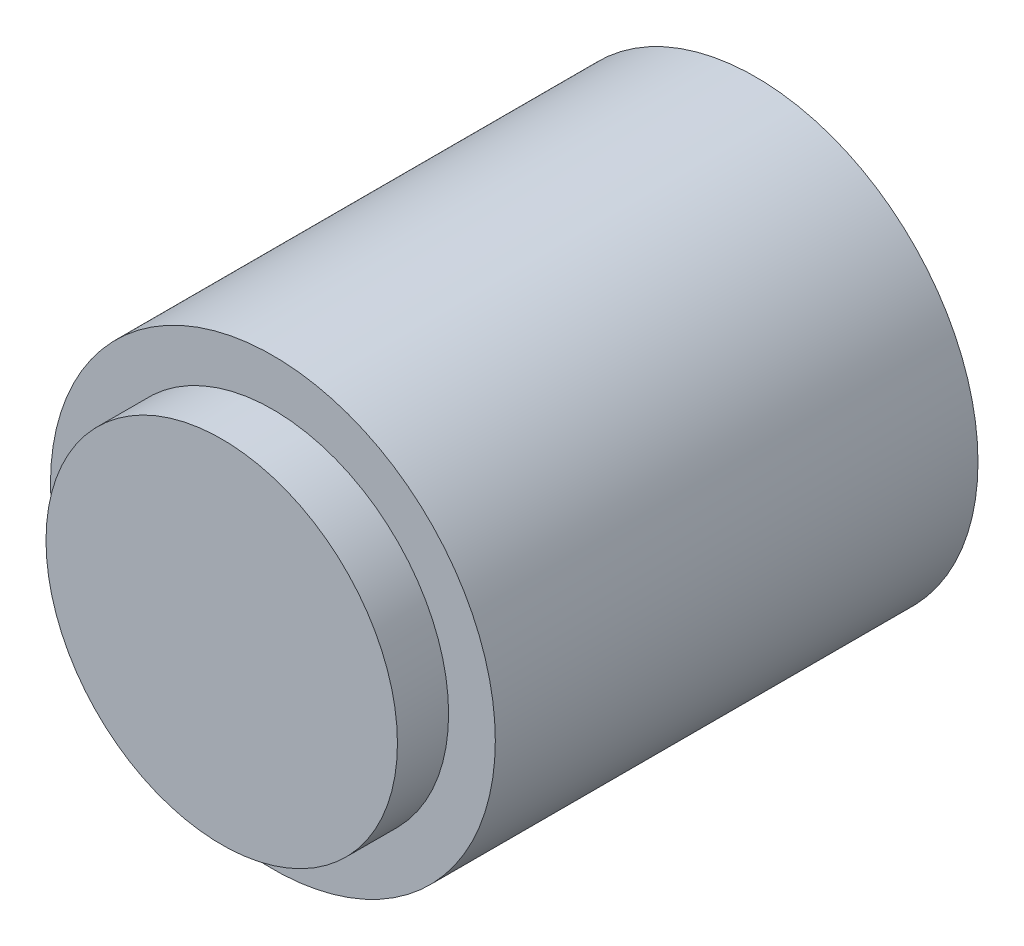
ISO-10303-21;
HEADER;
FILE_DESCRIPTION(('STEP AP214'),'2;1');
FILE_NAME('part.step','',(''),(''),'','','');
FILE_SCHEMA(('AUTOMOTIVE_DESIGN { 1 0 10303 214 1 1 1 1 }'));
ENDSEC;
DATA;
#1=APPLICATION_CONTEXT('core data for automotive mechanical design processes');
#2=APPLICATION_PROTOCOL_DEFINITION('international standard','automotive_design',2000,#1);
#3=PRODUCT_CONTEXT('',#1,'mechanical');
#4=PRODUCT('Part','Part','',(#3));
#5=PRODUCT_RELATED_PRODUCT_CATEGORY('part','',(#4));
#6=PRODUCT_DEFINITION_FORMATION('','',#4);
#7=PRODUCT_DEFINITION_CONTEXT('part definition',#1,'design');
#8=PRODUCT_DEFINITION('design','',#6,#7);
#9=PRODUCT_DEFINITION_SHAPE('','',#8);
#10=(LENGTH_UNIT() NAMED_UNIT(*) SI_UNIT(.MILLI.,.METRE.));
#11=(NAMED_UNIT(*) PLANE_ANGLE_UNIT() SI_UNIT($,.RADIAN.));
#12=(NAMED_UNIT(*) SI_UNIT($,.STERADIAN.) SOLID_ANGLE_UNIT());
#13=UNCERTAINTY_MEASURE_WITH_UNIT(LENGTH_MEASURE(1.E-05),#10,'distance_accuracy_value','');
#14=(GEOMETRIC_REPRESENTATION_CONTEXT(3) GLOBAL_UNCERTAINTY_ASSIGNED_CONTEXT((#13)) GLOBAL_UNIT_ASSIGNED_CONTEXT((#10,
#11,#12)) REPRESENTATION_CONTEXT('',''));
#15=CARTESIAN_POINT('',(0.,0.,0.));
#16=DIRECTION('',(0.,0.,1.));
#17=DIRECTION('',(1.,0.,0.));
#18=AXIS2_PLACEMENT_3D('',#15,#16,#17);
#19=CARTESIAN_POINT('',(0.,0.,32.));
#20=DIRECTION('',(0.,0.,1.));
#21=DIRECTION('',(1.,0.,0.));
#22=AXIS2_PLACEMENT_3D('',#19,#20,#21);
#23=CYLINDRICAL_SURFACE('',#22,5.);
#24=CARTESIAN_POINT('',(0.,0.,0.));
#25=DIRECTION('',(0.,0.,1.));
#26=DIRECTION('',(1.,0.,0.));
#27=AXIS2_PLACEMENT_3D('',#24,#25,#26);
#28=CIRCLE('',#27,5.);
#29=CARTESIAN_POINT('',(5.,0.,0.));
#30=VERTEX_POINT('',#29);
#31=EDGE_CURVE('E19',#30,#30,#28,.T.);
#32=ORIENTED_EDGE('',*,*,#31,.T.);
#33=EDGE_LOOP('',(#32));
#34=FACE_BOUND('',#33,.T.);
#35=CARTESIAN_POINT('',(0.,0.,10.85));
#36=DIRECTION('',(0.,0.,1.));
#37=DIRECTION('',(1.,0.,0.));
#38=AXIS2_PLACEMENT_3D('',#35,#36,#37);
#39=CIRCLE('',#38,5.);
#40=CARTESIAN_POINT('',(5.,0.,10.85));
#41=VERTEX_POINT('',#40);
#42=EDGE_CURVE('E28',#41,#41,#39,.T.);
#43=ORIENTED_EDGE('',*,*,#42,.F.);
#44=EDGE_LOOP('',(#43));
#45=FACE_BOUND('',#44,.T.);
#46=ADVANCED_FACE('F12',(#34,#45),#23,.T.);
#47=CARTESIAN_POINT('',(0.,0.,32.));
#48=DIRECTION('',(0.,0.,1.));
#49=DIRECTION('',(1.,0.,0.));
#50=AXIS2_PLACEMENT_3D('',#47,#48,#49);
#51=CYLINDRICAL_SURFACE('',#50,2.5);
#52=CARTESIAN_POINT('',(0.,0.,8.));
#53=DIRECTION('',(0.,0.,-1.));
#54=DIRECTION('',(-1.,0.,0.));
#55=AXIS2_PLACEMENT_3D('',#52,#53,#54);
#56=CIRCLE('',#55,2.5);
#57=CARTESIAN_POINT('',(-2.5,0.,8.));
#58=VERTEX_POINT('',#57);
#59=EDGE_CURVE('E31',#58,#58,#56,.T.);
#60=ORIENTED_EDGE('',*,*,#59,.F.);
#61=EDGE_LOOP('',(#60));
#62=FACE_BOUND('',#61,.T.);
#63=CARTESIAN_POINT('',(0.,0.,0.));
#64=DIRECTION('',(0.,0.,1.));
#65=DIRECTION('',(1.,0.,0.));
#66=AXIS2_PLACEMENT_3D('',#63,#64,#65);
#67=CIRCLE('',#66,2.5);
#68=CARTESIAN_POINT('',(2.5,0.,0.));
#69=VERTEX_POINT('',#68);
#70=EDGE_CURVE('E8',#69,#69,#67,.T.);
#71=ORIENTED_EDGE('',*,*,#70,.F.);
#72=EDGE_LOOP('',(#71));
#73=FACE_BOUND('',#72,.T.);
#74=ADVANCED_FACE('F37',(#62,#73),#51,.F.);
#75=CARTESIAN_POINT('',(2.5,0.,0.));
#76=DIRECTION('',(0.,0.,1.));
#77=DIRECTION('',(1.,0.,0.));
#78=AXIS2_PLACEMENT_3D('',#75,#76,#77);
#79=PLANE('',#78);
#80=ORIENTED_EDGE('',*,*,#31,.F.);
#81=EDGE_LOOP('',(#80));
#82=FACE_BOUND('',#81,.T.);
#83=ORIENTED_EDGE('',*,*,#70,.T.);
#84=EDGE_LOOP('',(#83));
#85=FACE_BOUND('',#84,.T.);
#86=ADVANCED_FACE('F40',(#82,#85),#79,.F.);
#87=CARTESIAN_POINT('',(0.,0.,20.));
#88=DIRECTION('',(0.,0.,1.));
#89=DIRECTION('',(1.,0.,0.));
#90=AXIS2_PLACEMENT_3D('',#87,#88,#89);
#91=CYLINDRICAL_SURFACE('',#90,3.95);
#92=CARTESIAN_POINT('',(0.,0.,10.85));
#93=DIRECTION('',(0.,0.,1.));
#94=DIRECTION('',(1.,0.,0.));
#95=AXIS2_PLACEMENT_3D('',#92,#93,#94);
#96=CIRCLE('',#95,3.95);
#97=CARTESIAN_POINT('',(3.95,0.,10.85));
#98=VERTEX_POINT('',#97);
#99=EDGE_CURVE('E25',#98,#98,#96,.T.);
#100=ORIENTED_EDGE('',*,*,#99,.T.);
#101=EDGE_LOOP('',(#100));
#102=FACE_BOUND('',#101,.T.);
#103=CARTESIAN_POINT('',(0.,0.,12.));
#104=DIRECTION('',(0.,0.,-1.));
#105=DIRECTION('',(-1.,0.,0.));
#106=AXIS2_PLACEMENT_3D('',#103,#104,#105);
#107=CIRCLE('',#106,3.95);
#108=CARTESIAN_POINT('',(-3.95,0.,12.));
#109=VERTEX_POINT('',#108);
#110=EDGE_CURVE('E15',#109,#109,#107,.T.);
#111=ORIENTED_EDGE('',*,*,#110,.T.);
#112=EDGE_LOOP('',(#111));
#113=FACE_BOUND('',#112,.T.);
#114=ADVANCED_FACE('F48',(#102,#113),#91,.T.);
#115=CARTESIAN_POINT('',(-3.95,0.,10.85));
#116=DIRECTION('',(0.,0.,1.));
#117=DIRECTION('',(1.,0.,0.));
#118=AXIS2_PLACEMENT_3D('',#115,#116,#117);
#119=PLANE('',#118);
#120=ORIENTED_EDGE('',*,*,#42,.T.);
#121=EDGE_LOOP('',(#120));
#122=FACE_BOUND('',#121,.T.);
#123=ORIENTED_EDGE('',*,*,#99,.F.);
#124=EDGE_LOOP('',(#123));
#125=FACE_BOUND('',#124,.T.);
#126=ADVANCED_FACE('F55',(#122,#125),#119,.T.);
#127=CARTESIAN_POINT('',(5.,0.,12.));
#128=DIRECTION('',(0.,0.,-1.));
#129=DIRECTION('',(-1.,0.,0.));
#130=AXIS2_PLACEMENT_3D('',#127,#128,#129);
#131=PLANE('',#130);
#132=ORIENTED_EDGE('',*,*,#110,.F.);
#133=EDGE_LOOP('',(#132));
#134=FACE_BOUND('',#133,.T.);
#135=ADVANCED_FACE('F53',(#134),#131,.F.);
#136=CARTESIAN_POINT('',(0.,0.,8.));
#137=DIRECTION('',(0.,0.,-1.));
#138=DIRECTION('',(-1.,0.,0.));
#139=AXIS2_PLACEMENT_3D('',#136,#137,#138);
#140=PLANE('',#139);
#141=ORIENTED_EDGE('',*,*,#59,.T.);
#142=EDGE_LOOP('',(#141));
#143=FACE_BOUND('',#142,.T.);
#144=ADVANCED_FACE('F35',(#143),#140,.T.);
#145=CLOSED_SHELL('',(#46,#74,#86,#114,#126,#135,#144));
#146=MANIFOLD_SOLID_BREP('B1',#145);
#147=ADVANCED_BREP_SHAPE_REPRESENTATION('',(#18,#146),#14);
#148=SHAPE_DEFINITION_REPRESENTATION(#9,#147);
ENDSEC;
END-ISO-10303-21;
